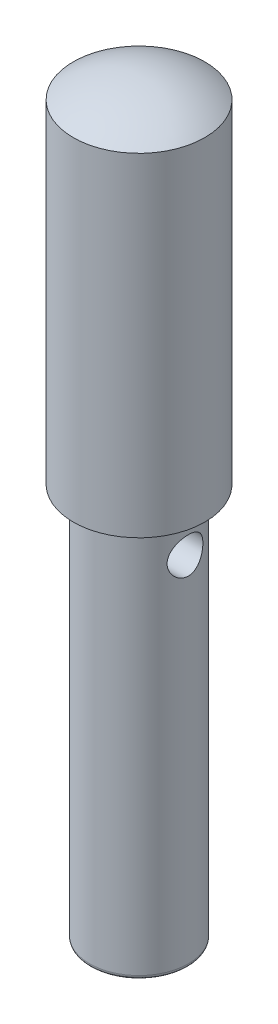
ISO-10303-21;
HEADER;
FILE_DESCRIPTION(('STEP AP214'),'2;1');
FILE_NAME('part.step','',(''),(''),'','','');
FILE_SCHEMA(('AUTOMOTIVE_DESIGN { 1 0 10303 214 1 1 1 1 }'));
ENDSEC;
DATA;
#1=APPLICATION_CONTEXT('core data for automotive mechanical design processes');
#2=APPLICATION_PROTOCOL_DEFINITION('international standard','automotive_design',2000,#1);
#3=PRODUCT_CONTEXT('',#1,'mechanical');
#4=PRODUCT('Part','Part','',(#3));
#5=PRODUCT_RELATED_PRODUCT_CATEGORY('part','',(#4));
#6=PRODUCT_DEFINITION_FORMATION('','',#4);
#7=PRODUCT_DEFINITION_CONTEXT('part definition',#1,'design');
#8=PRODUCT_DEFINITION('design','',#6,#7);
#9=PRODUCT_DEFINITION_SHAPE('','',#8);
#10=(LENGTH_UNIT() NAMED_UNIT(*) SI_UNIT(.MILLI.,.METRE.));
#11=(NAMED_UNIT(*) PLANE_ANGLE_UNIT() SI_UNIT($,.RADIAN.));
#12=(NAMED_UNIT(*) SI_UNIT($,.STERADIAN.) SOLID_ANGLE_UNIT());
#13=UNCERTAINTY_MEASURE_WITH_UNIT(LENGTH_MEASURE(1.E-05),#10,'distance_accuracy_value','');
#14=(GEOMETRIC_REPRESENTATION_CONTEXT(3) GLOBAL_UNCERTAINTY_ASSIGNED_CONTEXT((#13)) GLOBAL_UNIT_ASSIGNED_CONTEXT((#10,
#11,#12)) REPRESENTATION_CONTEXT('',''));
#15=CARTESIAN_POINT('',(0.,0.,0.));
#16=DIRECTION('',(0.,0.,1.));
#17=DIRECTION('',(1.,0.,0.));
#18=AXIS2_PLACEMENT_3D('',#15,#16,#17);
#19=CARTESIAN_POINT('',(0.,0.,0.));
#20=DIRECTION('',(0.,-1.,0.));
#21=DIRECTION('',(1.,0.,0.));
#22=AXIS2_PLACEMENT_3D('',#19,#20,#21);
#23=CYLINDRICAL_SURFACE('',#22,9.51357000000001);
#24=CARTESIAN_POINT('',(9.51357,72.51065,0.));
#25=CARTESIAN_POINT('',(9.51357348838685,72.5106547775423,-0.187494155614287));
#26=CARTESIAN_POINT('',(9.50797816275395,72.4953367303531,-0.374954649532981));
#27=CARTESIAN_POINT('',(9.4862139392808,72.4346990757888,-0.744296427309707));
#28=CARTESIAN_POINT('',(9.47004582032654,72.3893816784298,-0.926178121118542));
#29=CARTESIAN_POINT('',(9.4288779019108,72.2705436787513,-1.27898370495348));
#30=CARTESIAN_POINT('',(9.40389448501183,72.1970753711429,-1.44992723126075));
#31=CARTESIAN_POINT('',(9.34760231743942,72.0242783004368,-1.77705654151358));
#32=CARTESIAN_POINT('',(9.31629198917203,71.9249430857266,-1.93323863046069));
#33=CARTESIAN_POINT('',(9.24919031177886,71.6990546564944,-2.23268920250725));
#34=CARTESIAN_POINT('',(9.21327770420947,71.5716456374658,-2.37528471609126));
#35=CARTESIAN_POINT('',(9.1416358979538,71.2950434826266,-2.63761895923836));
#36=CARTESIAN_POINT('',(9.10590675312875,71.1458442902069,-2.75735131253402));
#37=CARTESIAN_POINT('',(9.0372896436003,70.8234759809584,-2.97470756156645));
#38=CARTESIAN_POINT('',(9.0045462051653,70.649647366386,-3.07140347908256));
#39=CARTESIAN_POINT('',(8.9474818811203,70.2868167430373,-3.23389145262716));
#40=CARTESIAN_POINT('',(8.92315787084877,70.0978203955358,-3.29969497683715));
#41=CARTESIAN_POINT('',(8.88697698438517,69.7177425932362,-3.39591216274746));
#42=CARTESIAN_POINT('',(8.8746716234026,69.527028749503,-3.42760383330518));
#43=CARTESIAN_POINT('',(8.86260432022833,69.1426236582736,-3.45869405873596));
#44=CARTESIAN_POINT('',(8.86283760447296,68.9489335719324,-3.45810490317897));
#45=CARTESIAN_POINT('',(8.87543264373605,68.5755209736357,-3.42563181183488));
#46=CARTESIAN_POINT('',(8.88711995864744,68.3956202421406,-3.3954880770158));
#47=CARTESIAN_POINT('',(8.92019045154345,68.0436299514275,-3.30762705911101));
#48=CARTESIAN_POINT('',(8.9415749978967,67.8715414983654,-3.24990588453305));
#49=CARTESIAN_POINT('',(8.99205801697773,67.5363948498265,-3.10752001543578));
#50=CARTESIAN_POINT('',(9.02128945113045,67.3735572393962,-3.0223853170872));
#51=CARTESIAN_POINT('',(9.08412493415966,67.0639609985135,-2.82791608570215));
#52=CARTESIAN_POINT('',(9.11773042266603,66.9172076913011,-2.71857357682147));
#53=CARTESIAN_POINT('',(9.18809950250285,66.6342680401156,-2.47071389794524));
#54=CARTESIAN_POINT('',(9.22492899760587,66.499321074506,-2.33079738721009));
#55=CARTESIAN_POINT('',(9.29577573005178,66.2544510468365,-2.02988523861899));
#56=CARTESIAN_POINT('',(9.32979258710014,66.1445313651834,-1.86888675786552));
#57=CARTESIAN_POINT('',(9.39178432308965,65.951582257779,-1.52737868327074));
#58=CARTESIAN_POINT('',(9.41967012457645,65.8689415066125,-1.34663218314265));
#59=CARTESIAN_POINT('',(9.46560183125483,65.7356434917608,-0.972540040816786));
#60=CARTESIAN_POINT('',(9.4836518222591,65.6849729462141,-0.779199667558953));
#61=CARTESIAN_POINT('',(9.50717213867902,65.6193805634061,-0.395857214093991));
#62=CARTESIAN_POINT('',(9.51322976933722,65.6027881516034,-0.206176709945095));
#63=CARTESIAN_POINT('',(9.51388188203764,65.6009899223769,0.173331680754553));
#64=CARTESIAN_POINT('',(9.50847871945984,65.6157776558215,0.363159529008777));
#65=CARTESIAN_POINT('',(9.4872043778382,65.675033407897,0.730513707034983));
#66=CARTESIAN_POINT('',(9.47171216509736,65.7184276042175,0.908237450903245));
#67=CARTESIAN_POINT('',(9.43219656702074,65.8322718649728,1.2537734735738));
#68=CARTESIAN_POINT('',(9.40817207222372,65.902725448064,1.42158446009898));
#69=CARTESIAN_POINT('',(9.35312879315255,66.0708923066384,1.7479059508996));
#70=CARTESIAN_POINT('',(9.32192947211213,66.1693282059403,1.9060126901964));
#71=CARTESIAN_POINT('',(9.25601533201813,66.3898400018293,2.20397799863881));
#72=CARTESIAN_POINT('',(9.22129927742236,66.5119242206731,2.34383011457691));
#73=CARTESIAN_POINT('',(9.14984949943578,66.7840818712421,2.60925012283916));
#74=CARTESIAN_POINT('',(9.11310859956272,66.9353153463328,2.73362964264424));
#75=CARTESIAN_POINT('',(9.0436088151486,67.2572550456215,2.95545370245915));
#76=CARTESIAN_POINT('',(9.01085017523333,67.4279624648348,3.05289658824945));
#77=CARTESIAN_POINT('',(8.95322736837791,67.7849612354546,3.21798650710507));
#78=CARTESIAN_POINT('',(8.92837926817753,67.9712833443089,3.28557300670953));
#79=CARTESIAN_POINT('',(8.89002058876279,68.3538066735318,3.38800796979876));
#80=CARTESIAN_POINT('',(8.87650358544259,68.5500022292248,3.42287498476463));
#81=CARTESIAN_POINT('',(8.86315570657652,68.9339181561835,3.45728109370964));
#82=CARTESIAN_POINT('',(8.86254614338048,69.1214329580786,3.4588302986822));
#83=CARTESIAN_POINT('',(8.87310661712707,69.4938987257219,3.43164702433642));
#84=CARTESIAN_POINT('',(8.88427567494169,69.6788499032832,3.40291706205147));
#85=CARTESIAN_POINT('',(8.91650588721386,70.0359311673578,3.31751717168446));
#86=CARTESIAN_POINT('',(8.93729383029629,70.2082720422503,3.26161689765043));
#87=CARTESIAN_POINT('',(8.98627662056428,70.5412411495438,3.12412337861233));
#88=CARTESIAN_POINT('',(9.01447328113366,70.7018665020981,3.04252384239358));
#89=CARTESIAN_POINT('',(9.07685086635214,71.0155647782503,2.8512074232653));
#90=CARTESIAN_POINT('',(9.11126044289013,71.1678590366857,2.74028911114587));
#91=CARTESIAN_POINT('',(9.1813525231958,71.4523177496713,2.4953930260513));
#92=CARTESIAN_POINT('',(9.21703541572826,71.5844759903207,2.36140816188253));
#93=CARTESIAN_POINT('',(9.28777250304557,71.8315522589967,2.06625371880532));
#94=CARTESIAN_POINT('',(9.32270840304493,71.945294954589,1.90406765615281));
#95=CARTESIAN_POINT('',(9.38613213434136,72.1438408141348,1.56167069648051));
#96=CARTESIAN_POINT('',(9.41462013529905,72.2286447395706,1.38146027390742));
#97=CARTESIAN_POINT('',(9.46229608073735,72.3674830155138,1.00477089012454));
#98=CARTESIAN_POINT('',(9.48131757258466,72.4209693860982,0.808067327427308));
#99=CARTESIAN_POINT('',(9.50695000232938,72.4925427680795,0.407560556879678));
#100=CARTESIAN_POINT('',(9.51356620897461,72.5106448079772,0.203760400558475));
#101=CARTESIAN_POINT('',(9.51357,72.51065,0.));
#102=B_SPLINE_CURVE_WITH_KNOTS('',3,(#24,#25,#26,#27,#28,#29,#30,#31,#32,#33,#34,#35,#36,#37,
#38,#39,#40,#41,#42,#43,#44,#45,#46,#47,#48,#49,#50,#51,#52,#53,#54,#55,#56,#57,#58,#59,#60,#61,
#62,#63,#64,#65,#66,#67,#68,#69,#70,#71,#72,#73,#74,#75,#76,#77,#78,#79,#80,#81,#82,#83,#84,#85,
#86,#87,#88,#89,#90,#91,#92,#93,#94,#95,#96,#97,#98,#99,#100,#101),.UNSPECIFIED.,.T.,.F.,(4,2,2,
2,2,2,2,2,2,2,2,2,2,2,2,2,2,2,2,2,2,2,2,2,2,2,2,2,2,2,2,2,2,2,2,2,2,2,4),(0.,0.561731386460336,
1.12342139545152,1.68407299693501,2.24486456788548,2.82597600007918,3.40724926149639,
4.0090101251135,4.61054742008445,5.18866667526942,5.7665658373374,6.31236347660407,
6.85823815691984,7.4140203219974,7.96998587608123,8.56080855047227,9.15171097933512,
9.75070180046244,10.349443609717,10.9180566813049,11.486552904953,12.0348390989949,
12.5831966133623,13.1472519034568,13.7115060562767,14.3064066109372,14.9013436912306,
15.4974815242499,16.0932811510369,16.6530273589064,17.2127270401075,17.7574224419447,
18.3022512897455,18.8743095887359,19.4465440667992,20.0470686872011,20.6475775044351,
21.2583019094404,21.8687668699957),.UNSPECIFIED.);
#103=CARTESIAN_POINT('',(9.51357,72.51065,0.));
#104=VERTEX_POINT('',#103);
#105=EDGE_CURVE('E85',#104,#104,#102,.T.);
#106=ORIENTED_EDGE('',*,*,#105,.T.);
#107=EDGE_LOOP('',(#106));
#108=FACE_BOUND('',#107,.T.);
#109=CARTESIAN_POINT('',(0.,0.793750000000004,0.));
#110=DIRECTION('',(0.,-1.,0.));
#111=DIRECTION('',(1.,0.,0.));
#112=AXIS2_PLACEMENT_3D('',#109,#110,#111);
#113=CIRCLE('',#112,9.51357000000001);
#114=CARTESIAN_POINT('',(9.51357000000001,0.793750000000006,0.));
#115=VERTEX_POINT('',#114);
#116=EDGE_CURVE('E74',#115,#115,#113,.T.);
#117=ORIENTED_EDGE('',*,*,#116,.F.);
#118=EDGE_LOOP('',(#117));
#119=FACE_BOUND('',#118,.T.);
#120=CARTESIAN_POINT('',(0.,75.692,0.));
#121=DIRECTION('',(0.,-1.,0.));
#122=DIRECTION('',(1.,0.,0.));
#123=AXIS2_PLACEMENT_3D('',#120,#121,#122);
#124=CIRCLE('',#123,9.51357);
#125=CARTESIAN_POINT('',(9.51356999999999,75.692,0.));
#126=VERTEX_POINT('',#125);
#127=EDGE_CURVE('E71',#126,#126,#124,.T.);
#128=ORIENTED_EDGE('',*,*,#127,.T.);
#129=EDGE_LOOP('',(#128));
#130=FACE_BOUND('',#129,.T.);
#131=CARTESIAN_POINT('',(-8.63744553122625,69.05625,3.9878));
#132=CARTESIAN_POINT('',(-8.63744633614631,69.162579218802,3.98779921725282));
#133=CARTESIAN_POINT('',(-8.63941585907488,69.268945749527,3.98354092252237));
#134=CARTESIAN_POINT('',(-8.64722851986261,69.4809024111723,3.96655232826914));
#135=CARTESIAN_POINT('',(-8.65307416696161,69.5864919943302,3.95381654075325));
#136=CARTESIAN_POINT('',(-8.66845781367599,69.7962870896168,3.91997456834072));
#137=CARTESIAN_POINT('',(-8.67800360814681,69.9004891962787,3.89885071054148));
#138=CARTESIAN_POINT('',(-8.70046412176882,70.1065501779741,3.84846598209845));
#139=CARTESIAN_POINT('',(-8.71338025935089,70.2084080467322,3.81920168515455));
#140=CARTESIAN_POINT('',(-8.75646094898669,70.5085150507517,3.71989932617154));
#141=CARTESIAN_POINT('',(-8.79104566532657,70.70240289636,3.63817028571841));
#142=CARTESIAN_POINT('',(-8.86802606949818,71.0735590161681,3.44626632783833));
#143=CARTESIAN_POINT('',(-8.91041997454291,71.2508310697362,3.33609790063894));
#144=CARTESIAN_POINT('',(-9.00123637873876,71.595130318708,3.08298890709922));
#145=CARTESIAN_POINT('',(-9.04986492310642,71.7609936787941,2.93853566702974));
#146=CARTESIAN_POINT('',(-9.14597749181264,72.0669958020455,2.62414133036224));
#147=CARTESIAN_POINT('',(-9.19346106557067,72.2071245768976,2.45419038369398));
#148=CARTESIAN_POINT('',(-9.28444253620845,72.4636594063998,2.08444344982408));
#149=CARTESIAN_POINT('',(-9.32767321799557,72.5787507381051,1.88366345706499));
#150=CARTESIAN_POINT('',(-9.40275313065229,72.7730178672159,1.46345253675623));
#151=CARTESIAN_POINT('',(-9.43460747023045,72.8522097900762,1.24403003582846));
#152=CARTESIAN_POINT('',(-9.4818844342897,72.9681960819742,0.805002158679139));
#153=CARTESIAN_POINT('',(-9.49808311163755,73.0070011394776,0.586013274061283));
#154=CARTESIAN_POINT('',(-9.51504471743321,73.0476124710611,0.144073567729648));
#155=CARTESIAN_POINT('',(-9.51581398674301,73.0494339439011,-0.0788755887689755));
#156=CARTESIAN_POINT('',(-9.50228462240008,73.0170725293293,-0.507773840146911));
#157=CARTESIAN_POINT('',(-9.48891093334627,72.9850998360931,-0.713924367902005));
#158=CARTESIAN_POINT('',(-9.44987212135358,72.8898509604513,-1.11761951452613));
#159=CARTESIAN_POINT('',(-9.42420609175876,72.8265724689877,-1.31516349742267));
#160=CARTESIAN_POINT('',(-9.36256726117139,72.6697607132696,-1.69966873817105));
#161=CARTESIAN_POINT('',(-9.32644303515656,72.5757801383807,-1.88642229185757));
#162=CARTESIAN_POINT('',(-9.247415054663,72.3606734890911,-2.24199777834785));
#163=CARTESIAN_POINT('',(-9.2045088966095,72.2395377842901,-2.41081331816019));
#164=CARTESIAN_POINT('',(-9.11260865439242,71.9635297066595,-2.73849724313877));
#165=CARTESIAN_POINT('',(-9.06339862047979,71.8068690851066,-2.89580099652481));
#166=CARTESIAN_POINT('',(-8.9667228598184,71.4692942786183,-3.18258497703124));
#167=CARTESIAN_POINT('',(-8.91925782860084,71.2883705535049,-3.3120542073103));
#168=CARTESIAN_POINT('',(-8.8298933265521,70.8997324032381,-3.5435792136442));
#169=CARTESIAN_POINT('',(-8.78823445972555,70.691322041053,-3.64456766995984));
#170=CARTESIAN_POINT('',(-8.71807301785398,70.2582434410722,-3.80937457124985));
#171=CARTESIAN_POINT('',(-8.68956090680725,70.033587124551,-3.87321996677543));
#172=CARTESIAN_POINT('',(-8.6512942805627,69.5900790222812,-3.95792331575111));
#173=CARTESIAN_POINT('',(-8.64043445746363,69.3718093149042,-3.98132075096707));
#174=CARTESIAN_POINT('',(-8.6355408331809,68.9342393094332,-3.99193042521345));
#175=CARTESIAN_POINT('',(-8.64150109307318,68.7149394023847,-3.97915543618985));
#176=CARTESIAN_POINT('',(-8.66843298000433,68.2965901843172,-3.92010111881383));
#177=CARTESIAN_POINT('',(-8.68840151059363,68.0971522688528,-3.87605839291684));
#178=CARTESIAN_POINT('',(-8.73981241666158,67.7086662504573,-3.758692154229));
#179=CARTESIAN_POINT('',(-8.7712574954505,67.5196206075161,-3.68536174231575));
#180=CARTESIAN_POINT('',(-8.84370909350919,67.1482823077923,-3.50803948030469));
#181=CARTESIAN_POINT('',(-8.88506585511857,66.9666203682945,-3.40287456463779));
#182=CARTESIAN_POINT('',(-8.97218863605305,66.622642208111,-3.16603086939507));
#183=CARTESIAN_POINT('',(-9.01795657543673,66.4603344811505,-3.03434051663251));
#184=CARTESIAN_POINT('',(-9.11330538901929,66.1457197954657,-2.73536864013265));
#185=CARTESIAN_POINT('',(-9.16288902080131,65.9953455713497,-2.56604604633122));
#186=CARTESIAN_POINT('',(-9.25677915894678,65.7247906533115,-2.2034277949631));
#187=CARTESIAN_POINT('',(-9.30108525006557,65.6046123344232,-2.01013025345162));
#188=CARTESIAN_POINT('',(-9.37973991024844,65.397939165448,-1.60356978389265));
#189=CARTESIAN_POINT('',(-9.41405790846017,65.3115474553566,-1.39024814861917));
#190=CARTESIAN_POINT('',(-9.46857806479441,65.1765128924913,-0.950289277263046));
#191=CARTESIAN_POINT('',(-9.48878873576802,65.1278472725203,-0.723660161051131));
#192=CARTESIAN_POINT('',(-9.51182715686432,65.0725386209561,-0.280784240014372));
#193=CARTESIAN_POINT('',(-9.51578134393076,65.0631715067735,-0.0649339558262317));
#194=CARTESIAN_POINT('',(-9.50898942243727,65.0793823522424,0.365190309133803));
#195=CARTESIAN_POINT('',(-9.49824594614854,65.1049540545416,0.579464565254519));
#196=CARTESIAN_POINT('',(-9.46386144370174,65.1883605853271,0.992347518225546));
#197=CARTESIAN_POINT('',(-9.4407017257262,65.2449931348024,1.19124251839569));
#198=CARTESIAN_POINT('',(-9.384041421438,65.3875942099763,1.57662706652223));
#199=CARTESIAN_POINT('',(-9.35053888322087,65.4735682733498,1.76311426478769));
#200=CARTESIAN_POINT('',(-9.27454354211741,65.6767588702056,2.12769941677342));
#201=CARTESIAN_POINT('',(-9.2317122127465,65.7952143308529,2.30503457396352));
#202=CARTESIAN_POINT('',(-9.14212111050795,66.0582210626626,2.63807230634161));
#203=CARTESIAN_POINT('',(-9.0953598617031,66.2027821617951,2.79376669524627));
#204=CARTESIAN_POINT('',(-8.99912312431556,66.5256152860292,3.09026692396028));
#205=CARTESIAN_POINT('',(-8.94968300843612,66.7055252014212,3.2293039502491));
#206=CARTESIAN_POINT('',(-8.85698264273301,67.0877757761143,3.47552379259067));
#207=CARTESIAN_POINT('',(-8.8137258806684,67.2901289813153,3.58268866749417));
#208=CARTESIAN_POINT('',(-8.75775667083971,67.6058769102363,3.71645218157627));
#209=CARTESIAN_POINT('',(-8.7406081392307,67.7129679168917,3.75649688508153));
#210=CARTESIAN_POINT('',(-8.7098164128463,67.9306343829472,3.82735039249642));
#211=CARTESIAN_POINT('',(-8.6961714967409,68.0412081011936,3.85816373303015));
#212=CARTESIAN_POINT('',(-8.67292882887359,68.2646970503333,3.91013147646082));
#213=CARTESIAN_POINT('',(-8.66332040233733,68.3776052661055,3.93131136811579));
#214=CARTESIAN_POINT('',(-8.64847901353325,68.6050550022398,3.96385535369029));
#215=CARTESIAN_POINT('',(-8.64324265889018,68.7195951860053,3.97522705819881));
#216=CARTESIAN_POINT('',(-8.63934513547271,68.8713505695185,3.98368318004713));
#217=CARTESIAN_POINT('',(-8.63863327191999,68.9083083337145,3.98522652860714));
#218=CARTESIAN_POINT('',(-8.63768332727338,68.9822592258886,3.98728508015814));
#219=CARTESIAN_POINT('',(-8.63744525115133,69.0192523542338,3.98780027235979));
#220=CARTESIAN_POINT('',(-8.63744553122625,69.05625,3.9878));
#221=B_SPLINE_CURVE_WITH_KNOTS('',3,(#131,#132,#133,#134,#135,#136,#137,#138,#139,#140,#141,
#142,#143,#144,#145,#146,#147,#148,#149,#150,#151,#152,#153,#154,#155,#156,#157,#158,#159,#160,
#161,#162,#163,#164,#165,#166,#167,#168,#169,#170,#171,#172,#173,#174,#175,#176,#177,#178,#179,
#180,#181,#182,#183,#184,#185,#186,#187,#188,#189,#190,#191,#192,#193,#194,#195,#196,#197,#198,
#199,#200,#201,#202,#203,#204,#205,#206,#207,#208,#209,#210,#211,#212,#213,#214,#215,#216,#217,
#218,#219,#220),.UNSPECIFIED.,.T.,.F.,(4,2,2,2,2,2,2,2,2,2,2,2,2,2,2,2,2,2,2,2,2,2,2,2,2,2,2,2,
2,2,2,2,2,2,2,2,2,2,2,2,2,2,2,2,4),(0.,0.318948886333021,0.638104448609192,0.957936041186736,
1.27790245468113,1.91450715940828,2.55096671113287,3.22378635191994,3.89686658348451,
4.59955551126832,5.30192848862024,5.96736319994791,6.63252443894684,7.25672592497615,
7.88097345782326,8.51475490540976,9.14876147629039,9.82792039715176,10.5073471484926,
11.2096038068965,11.9113502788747,12.5671786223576,13.2227754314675,13.8356681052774,
14.4487052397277,15.0878568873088,15.7272880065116,16.4195237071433,17.1118138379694,
17.8062011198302,18.5001690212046,19.1451456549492,19.790006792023,20.4115080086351,
21.0331265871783,21.6829063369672,22.33293122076,23.0278121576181,23.7230835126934,
24.0695293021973,24.415804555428,24.7611582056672,25.1062436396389,25.2172219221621,
25.3282013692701),.UNSPECIFIED.);
#222=CARTESIAN_POINT('',(-8.63744553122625,69.05625,3.9878));
#223=VERTEX_POINT('',#222);
#224=EDGE_CURVE('E10',#223,#223,#221,.T.);
#225=ORIENTED_EDGE('',*,*,#224,.F.);
#226=EDGE_LOOP('',(#225));
#227=FACE_BOUND('',#226,.T.);
#228=ADVANCED_FACE('F38',(#108,#119,#130,#227),#23,.T.);
#229=CARTESIAN_POINT('',(0.,122.32132,0.));
#230=DIRECTION('',(0.,-1.,0.));
#231=DIRECTION('',(1.,0.,0.));
#232=AXIS2_PLACEMENT_3D('',#229,#230,#231);
#233=SPHERICAL_SURFACE('',#232,22.14118);
#234=CARTESIAN_POINT('',(0.,140.466072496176,0.));
#235=DIRECTION('',(0.,-1.,0.));
#236=DIRECTION('',(1.,0.,0.));
#237=AXIS2_PLACEMENT_3D('',#234,#235,#236);
#238=CIRCLE('',#237,12.68857);
#239=CARTESIAN_POINT('',(12.6885699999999,140.466072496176,0.));
#240=VERTEX_POINT('',#239);
#241=EDGE_CURVE('E51',#240,#240,#238,.T.);
#242=ORIENTED_EDGE('',*,*,#241,.F.);
#243=EDGE_LOOP('',(#242));
#244=FACE_BOUND('',#243,.T.);
#245=ADVANCED_FACE('F40',(#244),#233,.T.);
#246=CARTESIAN_POINT('',(0.,0.,0.));
#247=DIRECTION('',(0.,-1.,0.));
#248=DIRECTION('',(1.,0.,0.));
#249=AXIS2_PLACEMENT_3D('',#246,#247,#248);
#250=CYLINDRICAL_SURFACE('',#249,12.68857);
#251=CARTESIAN_POINT('',(0.,76.2,0.));
#252=DIRECTION('',(0.,-1.,0.));
#253=DIRECTION('',(1.,0.,0.));
#254=AXIS2_PLACEMENT_3D('',#251,#252,#253);
#255=CIRCLE('',#254,12.68857);
#256=CARTESIAN_POINT('',(12.68857,76.2,0.));
#257=VERTEX_POINT('',#256);
#258=EDGE_CURVE('E58',#257,#257,#255,.T.);
#259=ORIENTED_EDGE('',*,*,#258,.F.);
#260=EDGE_LOOP('',(#259));
#261=FACE_BOUND('',#260,.T.);
#262=ORIENTED_EDGE('',*,*,#241,.T.);
#263=EDGE_LOOP('',(#262));
#264=FACE_BOUND('',#263,.T.);
#265=ADVANCED_FACE('F128',(#261,#264),#250,.T.);
#266=CARTESIAN_POINT('',(-12.68857,76.2,0.));
#267=DIRECTION('',(0.,1.,0.));
#268=DIRECTION('',(-1.,0.,0.));
#269=AXIS2_PLACEMENT_3D('',#266,#267,#268);
#270=PLANE('',#269);
#271=CARTESIAN_POINT('',(0.,76.2,0.));
#272=DIRECTION('',(0.,-1.,0.));
#273=DIRECTION('',(1.,0.,0.));
#274=AXIS2_PLACEMENT_3D('',#271,#272,#273);
#275=CIRCLE('',#274,10.02157);
#276=CARTESIAN_POINT('',(10.02157,76.2,0.));
#277=VERTEX_POINT('',#276);
#278=EDGE_CURVE('E65',#277,#277,#275,.T.);
#279=ORIENTED_EDGE('',*,*,#278,.F.);
#280=EDGE_LOOP('',(#279));
#281=FACE_BOUND('',#280,.T.);
#282=ORIENTED_EDGE('',*,*,#258,.T.);
#283=EDGE_LOOP('',(#282));
#284=FACE_BOUND('',#283,.T.);
#285=ADVANCED_FACE('F119',(#281,#284),#270,.F.);
#286=CARTESIAN_POINT('',(0.,75.692,0.));
#287=DIRECTION('',(0.,-1.,0.));
#288=DIRECTION('',(1.,0.,0.));
#289=AXIS2_PLACEMENT_3D('',#286,#287,#288);
#290=TOROIDAL_SURFACE('',#289,10.02157,0.508000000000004);
#291=ORIENTED_EDGE('',*,*,#127,.F.);
#292=EDGE_LOOP('',(#291));
#293=FACE_BOUND('',#292,.T.);
#294=ORIENTED_EDGE('',*,*,#278,.T.);
#295=EDGE_LOOP('',(#294));
#296=FACE_BOUND('',#295,.T.);
#297=ADVANCED_FACE('F114',(#293,#296),#290,.F.);
#298=CARTESIAN_POINT('',(0.,0.793750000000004,0.));
#299=DIRECTION('',(0.,-1.,0.));
#300=DIRECTION('',(1.,0.,0.));
#301=AXIS2_PLACEMENT_3D('',#298,#299,#300);
#302=TOROIDAL_SURFACE('',#301,8.71982000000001,0.793750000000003);
#303=CARTESIAN_POINT('',(0.,0.,0.));
#304=DIRECTION('',(0.,-1.,0.));
#305=DIRECTION('',(1.,0.,0.));
#306=AXIS2_PLACEMENT_3D('',#303,#304,#305);
#307=CIRCLE('',#306,8.71982000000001);
#308=CARTESIAN_POINT('',(8.71982000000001,0.,0.));
#309=VERTEX_POINT('',#308);
#310=EDGE_CURVE('E78',#309,#309,#307,.T.);
#311=ORIENTED_EDGE('',*,*,#310,.F.);
#312=EDGE_LOOP('',(#311));
#313=FACE_BOUND('',#312,.T.);
#314=ORIENTED_EDGE('',*,*,#116,.T.);
#315=EDGE_LOOP('',(#314));
#316=FACE_BOUND('',#315,.T.);
#317=ADVANCED_FACE('F111',(#313,#316),#302,.T.);
#318=CARTESIAN_POINT('',(-8.71982000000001,0.,0.));
#319=DIRECTION('',(0.,1.,0.));
#320=DIRECTION('',(-1.,0.,0.));
#321=AXIS2_PLACEMENT_3D('',#318,#319,#320);
#322=PLANE('',#321);
#323=ORIENTED_EDGE('',*,*,#310,.T.);
#324=EDGE_LOOP('',(#323));
#325=FACE_BOUND('',#324,.T.);
#326=ADVANCED_FACE('F108',(#325),#322,.F.);
#327=CARTESIAN_POINT('',(-1.57607,69.05625,0.));
#328=DIRECTION('',(-1.,0.,0.));
#329=DIRECTION('',(0.,0.,1.));
#330=AXIS2_PLACEMENT_3D('',#327,#328,#329);
#331=CYLINDRICAL_SURFACE('',#330,3.9878);
#332=CARTESIAN_POINT('',(-1.57607,69.05625,0.));
#333=DIRECTION('',(1.,0.,0.));
#334=DIRECTION('',(0.,0.,-1.));
#335=AXIS2_PLACEMENT_3D('',#332,#333,#334);
#336=CIRCLE('',#335,3.9878);
#337=CARTESIAN_POINT('',(-1.57607,69.05625,-3.9878));
#338=VERTEX_POINT('',#337);
#339=EDGE_CURVE('E81',#338,#338,#336,.T.);
#340=ORIENTED_EDGE('',*,*,#339,.T.);
#341=EDGE_LOOP('',(#340));
#342=FACE_BOUND('',#341,.T.);
#343=ORIENTED_EDGE('',*,*,#224,.T.);
#344=EDGE_LOOP('',(#343));
#345=FACE_BOUND('',#344,.T.);
#346=ADVANCED_FACE('F103',(#342,#345),#331,.F.);
#347=CARTESIAN_POINT('',(-1.57607,69.05625,0.));
#348=DIRECTION('',(1.,0.,0.));
#349=DIRECTION('',(0.,0.,-1.));
#350=AXIS2_PLACEMENT_3D('',#347,#348,#349);
#351=PLANE('',#350);
#352=CARTESIAN_POINT('',(-1.57606999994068,69.05625,0.));
#353=DIRECTION('',(-1.,0.,0.));
#354=DIRECTION('',(0.,0.,1.));
#355=AXIS2_PLACEMENT_3D('',#352,#353,#354);
#356=CIRCLE('',#355,3.4544);
#357=CARTESIAN_POINT('',(-1.57606999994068,69.05625,3.4544));
#358=VERTEX_POINT('',#357);
#359=EDGE_CURVE('E92',#358,#358,#356,.T.);
#360=ORIENTED_EDGE('',*,*,#359,.F.);
#361=EDGE_LOOP('',(#360));
#362=FACE_BOUND('',#361,.T.);
#363=ORIENTED_EDGE('',*,*,#339,.F.);
#364=EDGE_LOOP('',(#363));
#365=FACE_BOUND('',#364,.T.);
#366=ADVANCED_FACE('F100',(#362,#365),#351,.F.);
#367=CARTESIAN_POINT('',(-1.57606999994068,69.05625,0.));
#368=DIRECTION('',(-1.,0.,0.));
#369=DIRECTION('',(0.,0.,1.));
#370=AXIS2_PLACEMENT_3D('',#367,#368,#369);
#371=CYLINDRICAL_SURFACE('',#370,3.4544);
#372=ORIENTED_EDGE('',*,*,#359,.T.);
#373=EDGE_LOOP('',(#372));
#374=FACE_BOUND('',#373,.T.);
#375=ORIENTED_EDGE('',*,*,#105,.F.);
#376=EDGE_LOOP('',(#375));
#377=FACE_BOUND('',#376,.T.);
#378=ADVANCED_FACE('F96',(#374,#377),#371,.F.);
#379=CLOSED_SHELL('',(#228,#245,#265,#285,#297,#317,#326,#346,#366,#378));
#380=MANIFOLD_SOLID_BREP('B2',#379);
#381=ADVANCED_BREP_SHAPE_REPRESENTATION('',(#18,#380),#14);
#382=SHAPE_DEFINITION_REPRESENTATION(#9,#381);
ENDSEC;
END-ISO-10303-21;
